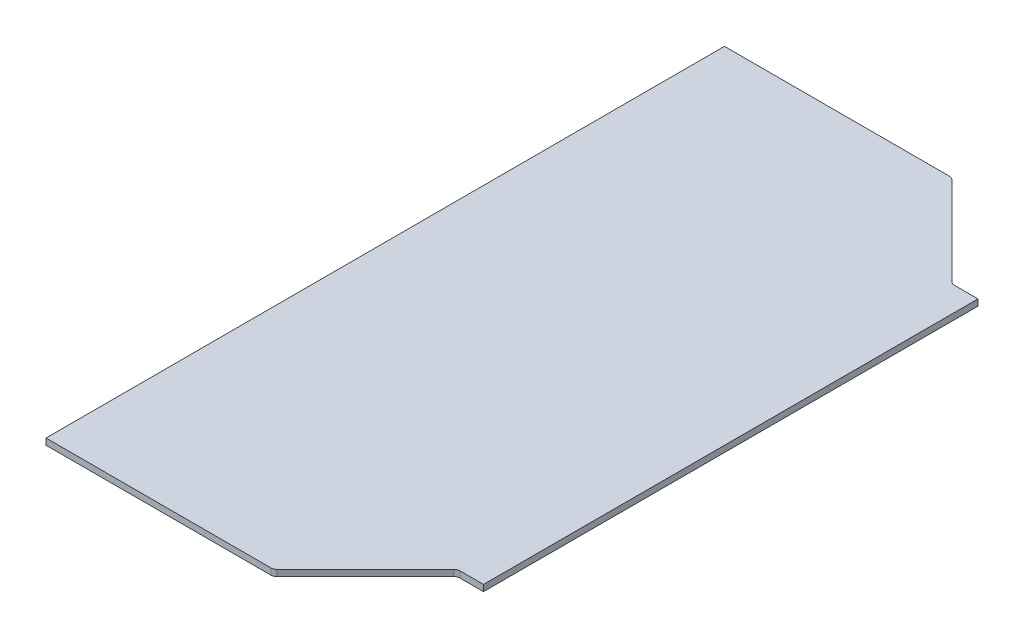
from build123d import *

# Parameters (mm, degrees)
SKETCH1_W      = 774.7
SKETCH1_H      = 1371.6
EXTRUDE1_DEPTH = 12.7
EXTRUDE2_DEPTH = 1576.312013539
FILLET1_R      = 12.7
SKETCH3_W      = 200.602317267
SKETCH3_H      = 1071.260644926
EXTRUDE3_DEPTH = 1576.312013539


with BuildPart() as part:
    # Sketch1 → Extrude1 (new body)
    with BuildSketch(Plane(origin=(0, 0, 0), x_dir=(1, 0, 0), z_dir=(0, 1, 0))):
        with Locations((387.35, 685.8)):
            Rectangle(SKETCH1_W, SKETCH1_H)
    extrude(amount=-EXTRUDE1_DEPTH)

    # Sketch2 → Extrude2 (cut, through all)
    with BuildSketch(Plane(origin=(0, 0, 0), x_dir=(1, 0, 0), z_dir=(0, 1, 0))):
        Polygon((459.74, 0), (645.668, 185.928), (774.7, 185.928), (774.7, 0), align=None)
        Polygon((459.74, 1371.6), (645.668, 1185.672), (774.7, 1185.672), (774.7, 1371.6), align=None)
    extrude(amount=-EXTRUDE2_DEPTH, mode=Mode.SUBTRACT)

    # Fillet1
    fillet1_edges = [part.edges().sort_by_distance(p)[0] for p in [
        (459.74, -6.35, 0),
        (645.668, -6.35, -185.928),
        (774.7, -6.35, -185.928),
        (459.74, -6.35, -1371.6),
        (774.7, -6.35, -1185.672),
        (645.668, -6.35, -1185.672),
    ]]
    fillet(fillet1_edges, radius=FILLET1_R)

    # Sketch3 → Extrude3 (cut, through all)
    with BuildSketch(Plane.XZ.offset(12.7)):
        with Locations((798.801158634, -673.985428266)):
            Rectangle(SKETCH3_W, SKETCH3_H)
    extrude(amount=-EXTRUDE3_DEPTH, mode=Mode.SUBTRACT)


solid = part.part
